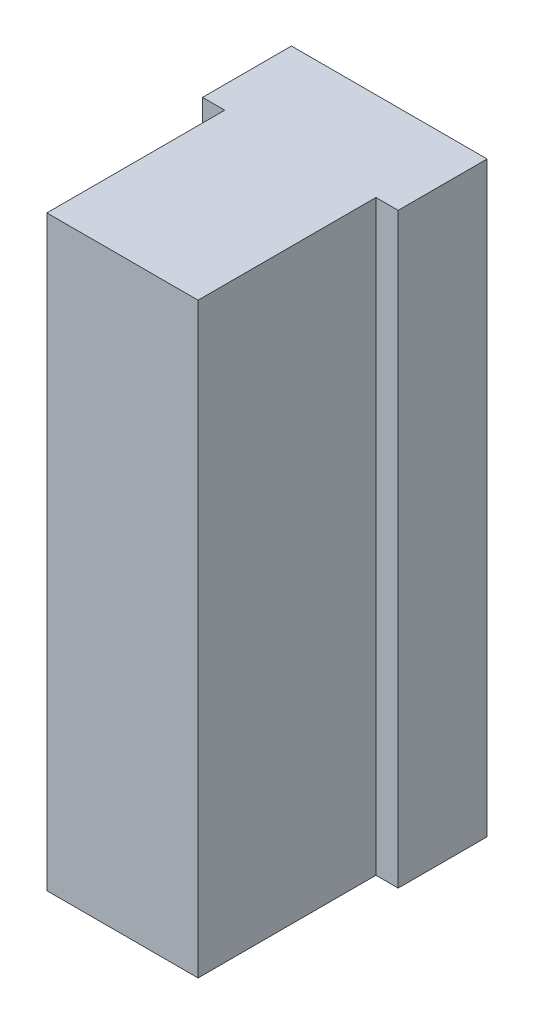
ISO-10303-21;
HEADER;
FILE_DESCRIPTION(('STEP AP214'),'2;1');
FILE_NAME('part.step','',(''),(''),'','','');
FILE_SCHEMA(('AUTOMOTIVE_DESIGN { 1 0 10303 214 1 1 1 1 }'));
ENDSEC;
DATA;
#1=APPLICATION_CONTEXT('core data for automotive mechanical design processes');
#2=APPLICATION_PROTOCOL_DEFINITION('international standard','automotive_design',2000,#1);
#3=PRODUCT_CONTEXT('',#1,'mechanical');
#4=PRODUCT('Part','Part','',(#3));
#5=PRODUCT_RELATED_PRODUCT_CATEGORY('part','',(#4));
#6=PRODUCT_DEFINITION_FORMATION('','',#4);
#7=PRODUCT_DEFINITION_CONTEXT('part definition',#1,'design');
#8=PRODUCT_DEFINITION('design','',#6,#7);
#9=PRODUCT_DEFINITION_SHAPE('','',#8);
#10=(LENGTH_UNIT() NAMED_UNIT(*) SI_UNIT(.MILLI.,.METRE.));
#11=(NAMED_UNIT(*) PLANE_ANGLE_UNIT() SI_UNIT($,.RADIAN.));
#12=(NAMED_UNIT(*) SI_UNIT($,.STERADIAN.) SOLID_ANGLE_UNIT());
#13=UNCERTAINTY_MEASURE_WITH_UNIT(LENGTH_MEASURE(1.E-05),#10,'distance_accuracy_value','');
#14=(GEOMETRIC_REPRESENTATION_CONTEXT(3) GLOBAL_UNCERTAINTY_ASSIGNED_CONTEXT((#13)) GLOBAL_UNIT_ASSIGNED_CONTEXT((#10,
#11,#12)) REPRESENTATION_CONTEXT('',''));
#15=CARTESIAN_POINT('',(0.,0.,0.));
#16=DIRECTION('',(0.,0.,1.));
#17=DIRECTION('',(1.,0.,0.));
#18=AXIS2_PLACEMENT_3D('',#15,#16,#17);
#19=CARTESIAN_POINT('',(-8.027700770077,16.764,-8.23423542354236));
#20=DIRECTION('',(1.,0.,0.));
#21=DIRECTION('',(0.,0.,-1.));
#22=AXIS2_PLACEMENT_3D('',#19,#20,#21);
#23=PLANE('',#22);
#24=DIRECTION('',(0.,0.,1.));
#25=VECTOR('',#24,1.);
#26=CARTESIAN_POINT('',(-8.027700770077,0.,-8.23423542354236));
#27=LINE('',#26,#25);
#28=CARTESIAN_POINT('',(-8.027700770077,0.,-13.3142354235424));
#29=VERTEX_POINT('',#28);
#30=CARTESIAN_POINT('',(-8.027700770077,0.,-8.23423542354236));
#31=VERTEX_POINT('',#30);
#32=EDGE_CURVE('E102',#29,#31,#27,.T.);
#33=ORIENTED_EDGE('',*,*,#32,.T.);
#34=DIRECTION('',(0.,-1.,0.));
#35=VECTOR('',#34,1.);
#36=CARTESIAN_POINT('',(-8.027700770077,16.764,-8.23423542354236));
#37=LINE('',#36,#35);
#38=CARTESIAN_POINT('',(-8.027700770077,16.764,-8.23423542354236));
#39=VERTEX_POINT('',#38);
#40=EDGE_CURVE('E11',#39,#31,#37,.T.);
#41=ORIENTED_EDGE('',*,*,#40,.F.);
#42=DIRECTION('',(0.,0.,1.));
#43=VECTOR('',#42,1.);
#44=CARTESIAN_POINT('',(-8.027700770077,16.764,-8.23423542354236));
#45=LINE('',#44,#43);
#46=CARTESIAN_POINT('',(-8.027700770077,16.764,-13.3142354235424));
#47=VERTEX_POINT('',#46);
#48=EDGE_CURVE('E129',#47,#39,#45,.T.);
#49=ORIENTED_EDGE('',*,*,#48,.F.);
#50=DIRECTION('',(0.,-1.,0.));
#51=VECTOR('',#50,1.);
#52=CARTESIAN_POINT('',(-8.027700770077,16.764,-13.3142354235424));
#53=LINE('',#52,#51);
#54=EDGE_CURVE('E115',#47,#29,#53,.T.);
#55=ORIENTED_EDGE('',*,*,#54,.T.);
#56=EDGE_LOOP('',(#33,#41,#49,#55));
#57=FACE_BOUND('',#56,.T.);
#58=ADVANCED_FACE('F34',(#57),#23,.F.);
#59=CARTESIAN_POINT('',(-8.027700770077,16.764,-8.23423542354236));
#60=DIRECTION('',(0.,0.,-1.));
#61=DIRECTION('',(-1.,0.,0.));
#62=AXIS2_PLACEMENT_3D('',#59,#60,#61);
#63=PLANE('',#62);
#64=DIRECTION('',(1.,0.,0.));
#65=VECTOR('',#64,1.);
#66=CARTESIAN_POINT('',(-8.027700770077,0.,-8.23423542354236));
#67=LINE('',#66,#65);
#68=CARTESIAN_POINT('',(-3.709700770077,0.,-8.23423542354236));
#69=VERTEX_POINT('',#68);
#70=EDGE_CURVE('E98',#31,#69,#67,.T.);
#71=ORIENTED_EDGE('',*,*,#70,.T.);
#72=DIRECTION('',(0.,-1.,0.));
#73=VECTOR('',#72,1.);
#74=CARTESIAN_POINT('',(-3.709700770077,16.764,-8.23423542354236));
#75=LINE('',#74,#73);
#76=CARTESIAN_POINT('',(-3.709700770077,16.764,-8.23423542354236));
#77=VERTEX_POINT('',#76);
#78=EDGE_CURVE('E41',#77,#69,#75,.T.);
#79=ORIENTED_EDGE('',*,*,#78,.F.);
#80=DIRECTION('',(1.,0.,0.));
#81=VECTOR('',#80,1.);
#82=CARTESIAN_POINT('',(-8.027700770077,16.764,-8.23423542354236));
#83=LINE('',#82,#81);
#84=EDGE_CURVE('E111',#39,#77,#83,.T.);
#85=ORIENTED_EDGE('',*,*,#84,.F.);
#86=ORIENTED_EDGE('',*,*,#40,.T.);
#87=EDGE_LOOP('',(#71,#79,#85,#86));
#88=FACE_BOUND('',#87,.T.);
#89=ADVANCED_FACE('F110',(#88),#63,.F.);
#90=CARTESIAN_POINT('',(-3.709700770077,16.764,-8.23423542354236));
#91=DIRECTION('',(-1.,0.,0.));
#92=DIRECTION('',(0.,0.,1.));
#93=AXIS2_PLACEMENT_3D('',#90,#91,#92);
#94=PLANE('',#93);
#95=DIRECTION('',(0.,0.,-1.));
#96=VECTOR('',#95,1.);
#97=CARTESIAN_POINT('',(-3.709700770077,0.,-8.23423542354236));
#98=LINE('',#97,#96);
#99=CARTESIAN_POINT('',(-3.709700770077,0.,-13.3142354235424));
#100=VERTEX_POINT('',#99);
#101=EDGE_CURVE('E104',#69,#100,#98,.T.);
#102=ORIENTED_EDGE('',*,*,#101,.T.);
#103=DIRECTION('',(0.,-1.,0.));
#104=VECTOR('',#103,1.);
#105=CARTESIAN_POINT('',(-3.709700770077,16.764,-13.3142354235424));
#106=LINE('',#105,#104);
#107=CARTESIAN_POINT('',(-3.709700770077,16.764,-13.3142354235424));
#108=VERTEX_POINT('',#107);
#109=EDGE_CURVE('E155',#108,#100,#106,.T.);
#110=ORIENTED_EDGE('',*,*,#109,.F.);
#111=DIRECTION('',(0.,0.,-1.));
#112=VECTOR('',#111,1.);
#113=CARTESIAN_POINT('',(-3.709700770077,16.764,-8.23423542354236));
#114=LINE('',#113,#112);
#115=EDGE_CURVE('E132',#77,#108,#114,.T.);
#116=ORIENTED_EDGE('',*,*,#115,.F.);
#117=ORIENTED_EDGE('',*,*,#78,.T.);
#118=EDGE_LOOP('',(#102,#110,#116,#117));
#119=FACE_BOUND('',#118,.T.);
#120=ADVANCED_FACE('F159',(#119),#94,.F.);
#121=CARTESIAN_POINT('',(-3.709700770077,16.764,-13.3142354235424));
#122=DIRECTION('',(0.,0.,-1.));
#123=DIRECTION('',(-1.,0.,0.));
#124=AXIS2_PLACEMENT_3D('',#121,#122,#123);
#125=PLANE('',#124);
#126=DIRECTION('',(1.,0.,0.));
#127=VECTOR('',#126,1.);
#128=CARTESIAN_POINT('',(-3.709700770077,0.,-13.3142354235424));
#129=LINE('',#128,#127);
#130=CARTESIAN_POINT('',(-3.074700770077,0.,-13.3142354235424));
#131=VERTEX_POINT('',#130);
#132=EDGE_CURVE('E119',#100,#131,#129,.T.);
#133=ORIENTED_EDGE('',*,*,#132,.T.);
#134=DIRECTION('',(0.,-1.,0.));
#135=VECTOR('',#134,1.);
#136=CARTESIAN_POINT('',(-3.074700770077,16.764,-13.3142354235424));
#137=LINE('',#136,#135);
#138=CARTESIAN_POINT('',(-3.074700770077,16.764,-13.3142354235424));
#139=VERTEX_POINT('',#138);
#140=EDGE_CURVE('E152',#139,#131,#137,.T.);
#141=ORIENTED_EDGE('',*,*,#140,.F.);
#142=DIRECTION('',(1.,0.,0.));
#143=VECTOR('',#142,1.);
#144=CARTESIAN_POINT('',(-3.709700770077,16.764,-13.3142354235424));
#145=LINE('',#144,#143);
#146=EDGE_CURVE('E134',#108,#139,#145,.T.);
#147=ORIENTED_EDGE('',*,*,#146,.F.);
#148=ORIENTED_EDGE('',*,*,#109,.T.);
#149=EDGE_LOOP('',(#133,#141,#147,#148));
#150=FACE_BOUND('',#149,.T.);
#151=ADVANCED_FACE('F167',(#150),#125,.F.);
#152=CARTESIAN_POINT('',(-3.074700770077,16.764,-15.8542354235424));
#153=DIRECTION('',(-1.,0.,0.));
#154=DIRECTION('',(0.,0.,1.));
#155=AXIS2_PLACEMENT_3D('',#152,#153,#154);
#156=PLANE('',#155);
#157=DIRECTION('',(0.,0.,-1.));
#158=VECTOR('',#157,1.);
#159=CARTESIAN_POINT('',(-3.074700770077,0.,-15.8542354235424));
#160=LINE('',#159,#158);
#161=CARTESIAN_POINT('',(-3.074700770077,0.,-15.8542354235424));
#162=VERTEX_POINT('',#161);
#163=EDGE_CURVE('E121',#131,#162,#160,.T.);
#164=ORIENTED_EDGE('',*,*,#163,.T.);
#165=DIRECTION('',(0.,-1.,0.));
#166=VECTOR('',#165,1.);
#167=CARTESIAN_POINT('',(-3.074700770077,16.764,-15.8542354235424));
#168=LINE('',#167,#166);
#169=CARTESIAN_POINT('',(-3.074700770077,16.764,-15.8542354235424));
#170=VERTEX_POINT('',#169);
#171=EDGE_CURVE('E149',#170,#162,#168,.T.);
#172=ORIENTED_EDGE('',*,*,#171,.F.);
#173=DIRECTION('',(0.,0.,-1.));
#174=VECTOR('',#173,1.);
#175=CARTESIAN_POINT('',(-3.074700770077,16.764,-15.8542354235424));
#176=LINE('',#175,#174);
#177=EDGE_CURVE('E136',#139,#170,#176,.T.);
#178=ORIENTED_EDGE('',*,*,#177,.F.);
#179=ORIENTED_EDGE('',*,*,#140,.T.);
#180=EDGE_LOOP('',(#164,#172,#178,#179));
#181=FACE_BOUND('',#180,.T.);
#182=ADVANCED_FACE('F170',(#181),#156,.F.);
#183=CARTESIAN_POINT('',(-8.662700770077,16.764,-15.8542354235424));
#184=DIRECTION('',(0.,0.,1.));
#185=DIRECTION('',(1.,0.,0.));
#186=AXIS2_PLACEMENT_3D('',#183,#184,#185);
#187=PLANE('',#186);
#188=DIRECTION('',(-1.,0.,0.));
#189=VECTOR('',#188,1.);
#190=CARTESIAN_POINT('',(-8.662700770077,0.,-15.8542354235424));
#191=LINE('',#190,#189);
#192=CARTESIAN_POINT('',(-8.662700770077,0.,-15.8542354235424));
#193=VERTEX_POINT('',#192);
#194=EDGE_CURVE('E123',#162,#193,#191,.T.);
#195=ORIENTED_EDGE('',*,*,#194,.T.);
#196=DIRECTION('',(0.,-1.,0.));
#197=VECTOR('',#196,1.);
#198=CARTESIAN_POINT('',(-8.662700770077,16.764,-15.8542354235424));
#199=LINE('',#198,#197);
#200=CARTESIAN_POINT('',(-8.662700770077,16.764,-15.8542354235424));
#201=VERTEX_POINT('',#200);
#202=EDGE_CURVE('E146',#201,#193,#199,.T.);
#203=ORIENTED_EDGE('',*,*,#202,.F.);
#204=DIRECTION('',(-1.,0.,0.));
#205=VECTOR('',#204,1.);
#206=CARTESIAN_POINT('',(-8.662700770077,16.764,-15.8542354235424));
#207=LINE('',#206,#205);
#208=EDGE_CURVE('E138',#170,#201,#207,.T.);
#209=ORIENTED_EDGE('',*,*,#208,.F.);
#210=ORIENTED_EDGE('',*,*,#171,.T.);
#211=EDGE_LOOP('',(#195,#203,#209,#210));
#212=FACE_BOUND('',#211,.T.);
#213=ADVANCED_FACE('F175',(#212),#187,.F.);
#214=CARTESIAN_POINT('',(-8.662700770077,16.764,-15.8542354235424));
#215=DIRECTION('',(1.,0.,0.));
#216=DIRECTION('',(0.,0.,-1.));
#217=AXIS2_PLACEMENT_3D('',#214,#215,#216);
#218=PLANE('',#217);
#219=DIRECTION('',(0.,0.,1.));
#220=VECTOR('',#219,1.);
#221=CARTESIAN_POINT('',(-8.662700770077,0.,-15.8542354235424));
#222=LINE('',#221,#220);
#223=CARTESIAN_POINT('',(-8.662700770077,0.,-13.3142354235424));
#224=VERTEX_POINT('',#223);
#225=EDGE_CURVE('E125',#193,#224,#222,.T.);
#226=ORIENTED_EDGE('',*,*,#225,.T.);
#227=DIRECTION('',(0.,-1.,0.));
#228=VECTOR('',#227,1.);
#229=CARTESIAN_POINT('',(-8.662700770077,16.764,-13.3142354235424));
#230=LINE('',#229,#228);
#231=CARTESIAN_POINT('',(-8.662700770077,16.764,-13.3142354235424));
#232=VERTEX_POINT('',#231);
#233=EDGE_CURVE('E143',#232,#224,#230,.T.);
#234=ORIENTED_EDGE('',*,*,#233,.F.);
#235=DIRECTION('',(0.,0.,1.));
#236=VECTOR('',#235,1.);
#237=CARTESIAN_POINT('',(-8.662700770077,16.764,-15.8542354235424));
#238=LINE('',#237,#236);
#239=EDGE_CURVE('E53',#201,#232,#238,.T.);
#240=ORIENTED_EDGE('',*,*,#239,.F.);
#241=ORIENTED_EDGE('',*,*,#202,.T.);
#242=EDGE_LOOP('',(#226,#234,#240,#241));
#243=FACE_BOUND('',#242,.T.);
#244=ADVANCED_FACE('F178',(#243),#218,.F.);
#245=CARTESIAN_POINT('',(-8.662700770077,16.764,-13.3142354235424));
#246=DIRECTION('',(0.,0.,-1.));
#247=DIRECTION('',(-1.,0.,0.));
#248=AXIS2_PLACEMENT_3D('',#245,#246,#247);
#249=PLANE('',#248);
#250=DIRECTION('',(1.,0.,0.));
#251=VECTOR('',#250,1.);
#252=CARTESIAN_POINT('',(-8.662700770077,0.,-13.3142354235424));
#253=LINE('',#252,#251);
#254=EDGE_CURVE('E127',#224,#29,#253,.T.);
#255=ORIENTED_EDGE('',*,*,#254,.T.);
#256=ORIENTED_EDGE('',*,*,#54,.F.);
#257=DIRECTION('',(1.,0.,0.));
#258=VECTOR('',#257,1.);
#259=CARTESIAN_POINT('',(-8.662700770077,16.764,-13.3142354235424));
#260=LINE('',#259,#258);
#261=EDGE_CURVE('E48',#232,#47,#260,.T.);
#262=ORIENTED_EDGE('',*,*,#261,.F.);
#263=ORIENTED_EDGE('',*,*,#233,.T.);
#264=EDGE_LOOP('',(#255,#256,#262,#263));
#265=FACE_BOUND('',#264,.T.);
#266=ADVANCED_FACE('F180',(#265),#249,.F.);
#267=CARTESIAN_POINT('',(-8.027700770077,16.764,-13.3142354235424));
#268=DIRECTION('',(0.,-1.,0.));
#269=DIRECTION('',(0.,0.,-1.));
#270=AXIS2_PLACEMENT_3D('',#267,#268,#269);
#271=PLANE('',#270);
#272=ORIENTED_EDGE('',*,*,#48,.T.);
#273=ORIENTED_EDGE('',*,*,#84,.T.);
#274=ORIENTED_EDGE('',*,*,#115,.T.);
#275=ORIENTED_EDGE('',*,*,#146,.T.);
#276=ORIENTED_EDGE('',*,*,#177,.T.);
#277=ORIENTED_EDGE('',*,*,#208,.T.);
#278=ORIENTED_EDGE('',*,*,#239,.T.);
#279=ORIENTED_EDGE('',*,*,#261,.T.);
#280=EDGE_LOOP('',(#272,#273,#274,#275,#276,#277,#278,#279));
#281=FACE_BOUND('',#280,.T.);
#282=ADVANCED_FACE('F162',(#281),#271,.F.);
#283=CARTESIAN_POINT('',(-8.027700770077,0.,-13.3142354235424));
#284=DIRECTION('',(0.,-1.,0.));
#285=DIRECTION('',(0.,0.,-1.));
#286=AXIS2_PLACEMENT_3D('',#283,#284,#285);
#287=PLANE('',#286);
#288=ORIENTED_EDGE('',*,*,#32,.F.);
#289=ORIENTED_EDGE('',*,*,#254,.F.);
#290=ORIENTED_EDGE('',*,*,#225,.F.);
#291=ORIENTED_EDGE('',*,*,#194,.F.);
#292=ORIENTED_EDGE('',*,*,#163,.F.);
#293=ORIENTED_EDGE('',*,*,#132,.F.);
#294=ORIENTED_EDGE('',*,*,#101,.F.);
#295=ORIENTED_EDGE('',*,*,#70,.F.);
#296=EDGE_LOOP('',(#288,#289,#290,#291,#292,#293,#294,#295));
#297=FACE_BOUND('',#296,.T.);
#298=ADVANCED_FACE('F99',(#297),#287,.T.);
#299=CLOSED_SHELL('',(#58,#89,#120,#151,#182,#213,#244,#266,#282,#298));
#300=MANIFOLD_SOLID_BREP('B2',#299);
#301=ADVANCED_BREP_SHAPE_REPRESENTATION('',(#18,#300),#14);
#302=SHAPE_DEFINITION_REPRESENTATION(#9,#301);
ENDSEC;
END-ISO-10303-21;
